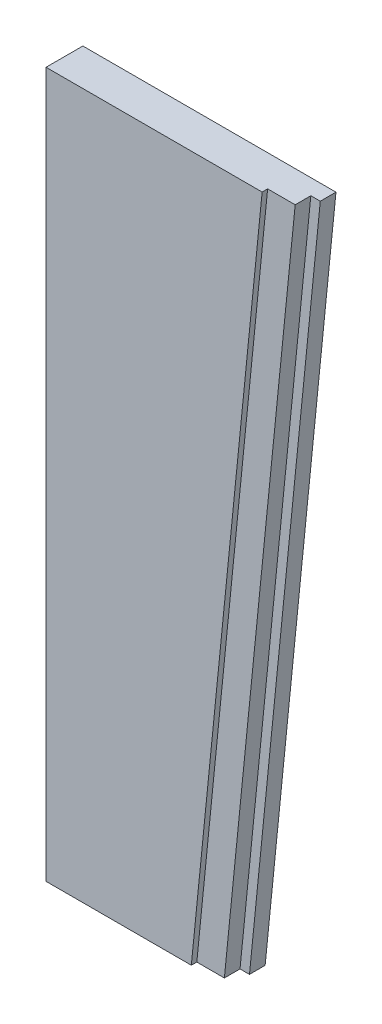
from build123d import *

# Parameters (mm, degrees)
EXTRUDE_1_DEPTH = 47
EXTRUDE_2_DEPTH = 40
EXTRUDE_3_DEPTH = 20


with BuildPart() as part:
    # Sketch 1 → Extrude 1 (new body)
    with BuildSketch(Plane.XY):
        Polygon((-1786.460757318, -900), (-1601.000259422, -900), (-1510.60329461, 0), (-1786.460757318, 0), align=None)
    extrude(amount=EXTRUDE_1_DEPTH)

    # Sketch 2 → Extrude 2 (add)
    with BuildSketch(Plane(origin=(0, 0, 0), x_dir=(-1, 0, 0), z_dir=(0, 0, -1))):
        Polygon((1510.60329461, 0), (1475.427190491, 0), (1565.824155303, -900), (1601.000259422, -900), align=None)
    extrude(amount=-EXTRUDE_2_DEPTH)

    # Sketch 3 → Extrude 3 (add)
    with BuildSketch(Plane(origin=(0, 0, 0), x_dir=(-1, 0, 0), z_dir=(0, 0, -1))):
        Polygon((1475.427190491, 0), (1463.366811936, 0), (1553.763776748, -900), (1565.824155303, -900), align=None)
    extrude(amount=-EXTRUDE_3_DEPTH)


solid = part.part
